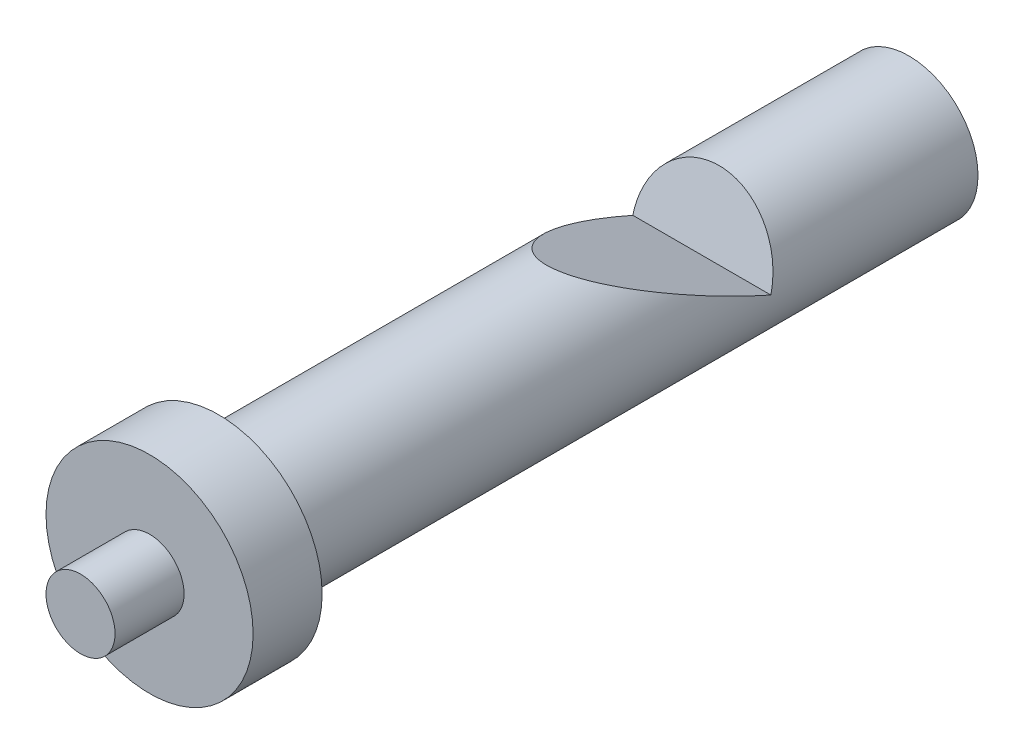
ISO-10303-21;
HEADER;
FILE_DESCRIPTION(('STEP AP214'),'2;1');
FILE_NAME('part.step','',(''),(''),'','','');
FILE_SCHEMA(('AUTOMOTIVE_DESIGN { 1 0 10303 214 1 1 1 1 }'));
ENDSEC;
DATA;
#1=APPLICATION_CONTEXT('core data for automotive mechanical design processes');
#2=APPLICATION_PROTOCOL_DEFINITION('international standard','automotive_design',2000,#1);
#3=PRODUCT_CONTEXT('',#1,'mechanical');
#4=PRODUCT('Part','Part','',(#3));
#5=PRODUCT_RELATED_PRODUCT_CATEGORY('part','',(#4));
#6=PRODUCT_DEFINITION_FORMATION('','',#4);
#7=PRODUCT_DEFINITION_CONTEXT('part definition',#1,'design');
#8=PRODUCT_DEFINITION('design','',#6,#7);
#9=PRODUCT_DEFINITION_SHAPE('','',#8);
#10=(LENGTH_UNIT() NAMED_UNIT(*) SI_UNIT(.MILLI.,.METRE.));
#11=(NAMED_UNIT(*) PLANE_ANGLE_UNIT() SI_UNIT($,.RADIAN.));
#12=(NAMED_UNIT(*) SI_UNIT($,.STERADIAN.) SOLID_ANGLE_UNIT());
#13=UNCERTAINTY_MEASURE_WITH_UNIT(LENGTH_MEASURE(1.E-05),#10,'distance_accuracy_value','');
#14=(GEOMETRIC_REPRESENTATION_CONTEXT(3) GLOBAL_UNCERTAINTY_ASSIGNED_CONTEXT((#13)) GLOBAL_UNIT_ASSIGNED_CONTEXT((#10,
#11,#12)) REPRESENTATION_CONTEXT('',''));
#15=CARTESIAN_POINT('',(0.,0.,0.));
#16=DIRECTION('',(0.,0.,1.));
#17=DIRECTION('',(1.,0.,0.));
#18=AXIS2_PLACEMENT_3D('',#15,#16,#17);
#19=CARTESIAN_POINT('',(-7.,33.,0.));
#20=DIRECTION('',(0.,0.,1.));
#21=DIRECTION('',(1.,0.,0.));
#22=AXIS2_PLACEMENT_3D('',#19,#20,#21);
#23=PLANE('',#22);
#24=CARTESIAN_POINT('',(-7.,33.,0.));
#25=DIRECTION('',(0.,0.,1.));
#26=DIRECTION('',(1.,0.,0.));
#27=AXIS2_PLACEMENT_3D('',#24,#25,#26);
#28=CIRCLE('',#27,3.);
#29=CARTESIAN_POINT('',(-4.,33.,0.));
#30=VERTEX_POINT('',#29);
#31=EDGE_CURVE('E65',#30,#30,#28,.T.);
#32=ORIENTED_EDGE('',*,*,#31,.T.);
#33=EDGE_LOOP('',(#32));
#34=FACE_BOUND('',#33,.T.);
#35=CARTESIAN_POINT('',(-7.,33.,0.));
#36=DIRECTION('',(0.,0.,1.));
#37=DIRECTION('',(1.,0.,0.));
#38=AXIS2_PLACEMENT_3D('',#35,#36,#37);
#39=CIRCLE('',#38,1.);
#40=CARTESIAN_POINT('',(-6.,33.,0.));
#41=VERTEX_POINT('',#40);
#42=EDGE_CURVE('E106',#41,#41,#39,.T.);
#43=ORIENTED_EDGE('',*,*,#42,.F.);
#44=EDGE_LOOP('',(#43));
#45=FACE_BOUND('',#44,.T.);
#46=ADVANCED_FACE('F31',(#34,#45),#23,.T.);
#47=CARTESIAN_POINT('',(-7.,33.,-22.));
#48=DIRECTION('',(0.,0.,1.));
#49=DIRECTION('',(1.,0.,0.));
#50=AXIS2_PLACEMENT_3D('',#47,#48,#49);
#51=CYLINDRICAL_SURFACE('',#50,2.);
#52=CARTESIAN_POINT('',(-7.,33.,-2.));
#53=DIRECTION('',(0.,0.,1.));
#54=DIRECTION('',(1.,0.,0.));
#55=AXIS2_PLACEMENT_3D('',#52,#53,#54);
#56=CIRCLE('',#55,2.);
#57=CARTESIAN_POINT('',(-5.,33.,-2.));
#58=VERTEX_POINT('',#57);
#59=EDGE_CURVE('E11',#58,#58,#56,.F.);
#60=ORIENTED_EDGE('',*,*,#59,.T.);
#61=EDGE_LOOP('',(#60));
#62=FACE_BOUND('',#61,.T.);
#63=CARTESIAN_POINT('',(-7.,33.,-22.));
#64=DIRECTION('',(0.,0.,-1.));
#65=DIRECTION('',(-1.,0.,0.));
#66=AXIS2_PLACEMENT_3D('',#63,#64,#65);
#67=CIRCLE('',#66,2.);
#68=CARTESIAN_POINT('',(-9.,33.,-22.));
#69=VERTEX_POINT('',#68);
#70=EDGE_CURVE('E52',#69,#69,#67,.T.);
#71=ORIENTED_EDGE('',*,*,#70,.F.);
#72=EDGE_LOOP('',(#71));
#73=FACE_BOUND('',#72,.T.);
#74=CARTESIAN_POINT('',(-7.,33.,-16.));
#75=DIRECTION('',(0.,0.913811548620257,-0.406138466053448));
#76=DIRECTION('',(0.,0.406138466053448,0.913811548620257));
#77=AXIS2_PLACEMENT_3D('',#74,#75,#76);
#78=ELLIPSE('',#77,4.92442890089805,2.);
#79=CARTESIAN_POINT('',(-5.,33.,-16.));
#80=VERTEX_POINT('',#79);
#81=CARTESIAN_POINT('',(-9.,33.,-16.));
#82=VERTEX_POINT('',#81);
#83=EDGE_CURVE('E45',#80,#82,#78,.F.);
#84=ORIENTED_EDGE('',*,*,#83,.T.);
#85=CARTESIAN_POINT('',(-7.,33.,-16.));
#86=DIRECTION('',(0.,0.242535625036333,0.970142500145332));
#87=DIRECTION('',(0.,-0.970142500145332,0.242535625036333));
#88=AXIS2_PLACEMENT_3D('',#85,#86,#87);
#89=ELLIPSE('',#88,2.06155281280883,2.);
#90=EDGE_CURVE('E54',#82,#80,#89,.F.);
#91=ORIENTED_EDGE('',*,*,#90,.T.);
#92=EDGE_LOOP('',(#84,#91));
#93=FACE_BOUND('',#92,.T.);
#94=ADVANCED_FACE('F59',(#62,#73,#93),#51,.T.);
#95=CARTESIAN_POINT('',(-7.,33.,-2.));
#96=DIRECTION('',(0.,0.,1.));
#97=DIRECTION('',(1.,0.,0.));
#98=AXIS2_PLACEMENT_3D('',#95,#96,#97);
#99=PLANE('',#98);
#100=CARTESIAN_POINT('',(-7.,33.,-2.));
#101=DIRECTION('',(0.,0.,1.));
#102=DIRECTION('',(1.,0.,0.));
#103=AXIS2_PLACEMENT_3D('',#100,#101,#102);
#104=CIRCLE('',#103,3.);
#105=CARTESIAN_POINT('',(-4.,33.,-2.));
#106=VERTEX_POINT('',#105);
#107=EDGE_CURVE('E39',#106,#106,#104,.T.);
#108=ORIENTED_EDGE('',*,*,#107,.F.);
#109=EDGE_LOOP('',(#108));
#110=FACE_BOUND('',#109,.T.);
#111=ORIENTED_EDGE('',*,*,#59,.F.);
#112=EDGE_LOOP('',(#111));
#113=FACE_BOUND('',#112,.T.);
#114=ADVANCED_FACE('F74',(#110,#113),#99,.F.);
#115=CARTESIAN_POINT('',(-7.,33.,-2.));
#116=DIRECTION('',(0.,0.,1.));
#117=DIRECTION('',(1.,0.,0.));
#118=AXIS2_PLACEMENT_3D('',#115,#116,#117);
#119=CYLINDRICAL_SURFACE('',#118,3.);
#120=ORIENTED_EDGE('',*,*,#107,.T.);
#121=EDGE_LOOP('',(#120));
#122=FACE_BOUND('',#121,.T.);
#123=ORIENTED_EDGE('',*,*,#31,.F.);
#124=EDGE_LOOP('',(#123));
#125=FACE_BOUND('',#124,.T.);
#126=ADVANCED_FACE('F33',(#122,#125),#119,.T.);
#127=CARTESIAN_POINT('',(-7.,33.,-22.));
#128=DIRECTION('',(0.,0.,-1.));
#129=DIRECTION('',(-1.,0.,0.));
#130=AXIS2_PLACEMENT_3D('',#127,#128,#129);
#131=PLANE('',#130);
#132=ORIENTED_EDGE('',*,*,#70,.T.);
#133=EDGE_LOOP('',(#132));
#134=FACE_BOUND('',#133,.T.);
#135=ADVANCED_FACE('F73',(#134),#131,.T.);
#136=CARTESIAN_POINT('',(-3.999,33.,-16.));
#137=DIRECTION('',(0.,0.913811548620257,-0.406138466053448));
#138=DIRECTION('',(0.,0.406138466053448,0.913811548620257));
#139=AXIS2_PLACEMENT_3D('',#136,#137,#138);
#140=PLANE('',#139);
#141=DIRECTION('',(-1.,0.,0.));
#142=VECTOR('',#141,1.);
#143=CARTESIAN_POINT('',(-3.999,33.,-16.));
#144=LINE('',#143,#142);
#145=EDGE_CURVE('E47',#80,#82,#144,.T.);
#146=ORIENTED_EDGE('',*,*,#145,.T.);
#147=ORIENTED_EDGE('',*,*,#83,.F.);
#148=EDGE_LOOP('',(#146,#147));
#149=FACE_BOUND('',#148,.T.);
#150=ADVANCED_FACE('F49',(#149),#140,.T.);
#151=CARTESIAN_POINT('',(-3.999,35.,-16.5));
#152=DIRECTION('',(0.,0.242535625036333,0.970142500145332));
#153=DIRECTION('',(0.,-0.970142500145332,0.242535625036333));
#154=AXIS2_PLACEMENT_3D('',#151,#152,#153);
#155=PLANE('',#154);
#156=ORIENTED_EDGE('',*,*,#145,.F.);
#157=ORIENTED_EDGE('',*,*,#90,.F.);
#158=EDGE_LOOP('',(#156,#157));
#159=FACE_BOUND('',#158,.T.);
#160=ADVANCED_FACE('F55',(#159),#155,.T.);
#161=CARTESIAN_POINT('',(-7.,33.,2.));
#162=DIRECTION('',(0.,0.,-1.));
#163=DIRECTION('',(-1.,0.,0.));
#164=AXIS2_PLACEMENT_3D('',#161,#162,#163);
#165=CYLINDRICAL_SURFACE('',#164,1.);
#166=CARTESIAN_POINT('',(-7.,33.,2.));
#167=DIRECTION('',(0.,0.,1.));
#168=DIRECTION('',(1.,0.,0.));
#169=AXIS2_PLACEMENT_3D('',#166,#167,#168);
#170=CIRCLE('',#169,1.);
#171=CARTESIAN_POINT('',(-6.,33.,2.));
#172=VERTEX_POINT('',#171);
#173=EDGE_CURVE('E57',#172,#172,#170,.T.);
#174=ORIENTED_EDGE('',*,*,#173,.F.);
#175=EDGE_LOOP('',(#174));
#176=FACE_BOUND('',#175,.T.);
#177=ORIENTED_EDGE('',*,*,#42,.T.);
#178=EDGE_LOOP('',(#177));
#179=FACE_BOUND('',#178,.T.);
#180=ADVANCED_FACE('F95',(#176,#179),#165,.T.);
#181=CARTESIAN_POINT('',(-7.,33.,2.));
#182=DIRECTION('',(0.,0.,1.));
#183=DIRECTION('',(1.,0.,0.));
#184=AXIS2_PLACEMENT_3D('',#181,#182,#183);
#185=PLANE('',#184);
#186=ORIENTED_EDGE('',*,*,#173,.T.);
#187=EDGE_LOOP('',(#186));
#188=FACE_BOUND('',#187,.T.);
#189=ADVANCED_FACE('F98',(#188),#185,.T.);
#190=CLOSED_SHELL('',(#46,#94,#114,#126,#135,#150,#160,#180,#189));
#191=MANIFOLD_SOLID_BREP('B2',#190);
#192=ADVANCED_BREP_SHAPE_REPRESENTATION('',(#18,#191),#14);
#193=SHAPE_DEFINITION_REPRESENTATION(#9,#192);
ENDSEC;
END-ISO-10303-21;
